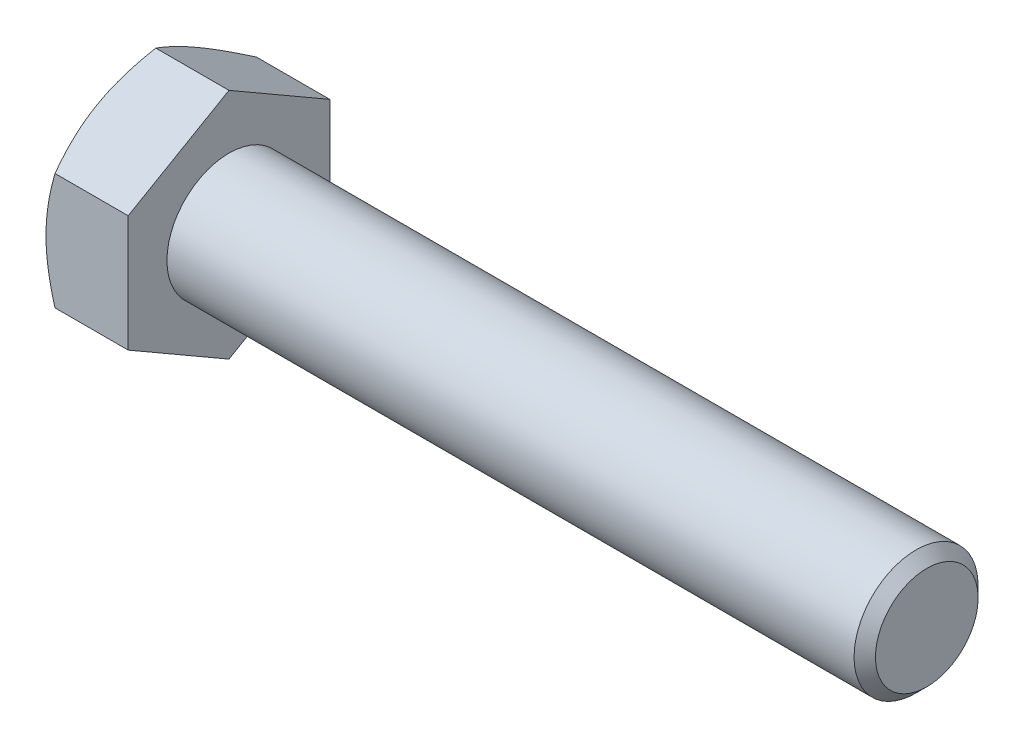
from build123d import *

# Parameters (mm, degrees)
BASEHEAD_DEPTH = 5.3


with BuildPart() as part:
    # Sketch1 → BaseHead (new body)
    with BuildSketch(Plane(origin=(0, 0, 0), x_dir=(0, 0, -1), z_dir=(1, 0, 0))):
        Polygon((6.5, 3.75277675), (6.5, -3.75277675), (0, -7.505553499), (-6.5, -3.75277675), (-6.5, 3.75277675), (0, 7.505553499), align=None)
    extrude(amount=BASEHEAD_DEPTH)

    # BodySke → BaseBody (revolve)
    with BuildSketch(Plane.XY, mode=Mode.PRIVATE) as basebody_sk:
        Polygon((0, 0), (50.3, 0), (50.3, 3.3095), (49.6095, 4), (0, 4), align=None)
    revolve(basebody_sk.sketch.rotate(Axis((0, 0, 0), (1, 0, 0)), 90), axis=Axis((0, 0, 0), (1, 0, 0)))

    # Sketch3 → HeadChamfer (revolve, cut)
    with BuildSketch(Plane.XY):
        Polygon((0, 6.5), (3.46730793, 12.505553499), (3.46730793, 17.505553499), (-10, 17.505553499), (-10, 6.5), align=None)
    revolve(axis=Axis((0, 0, 0), (1, 0, 0)), mode=Mode.SUBTRACT)


solid = part.part
